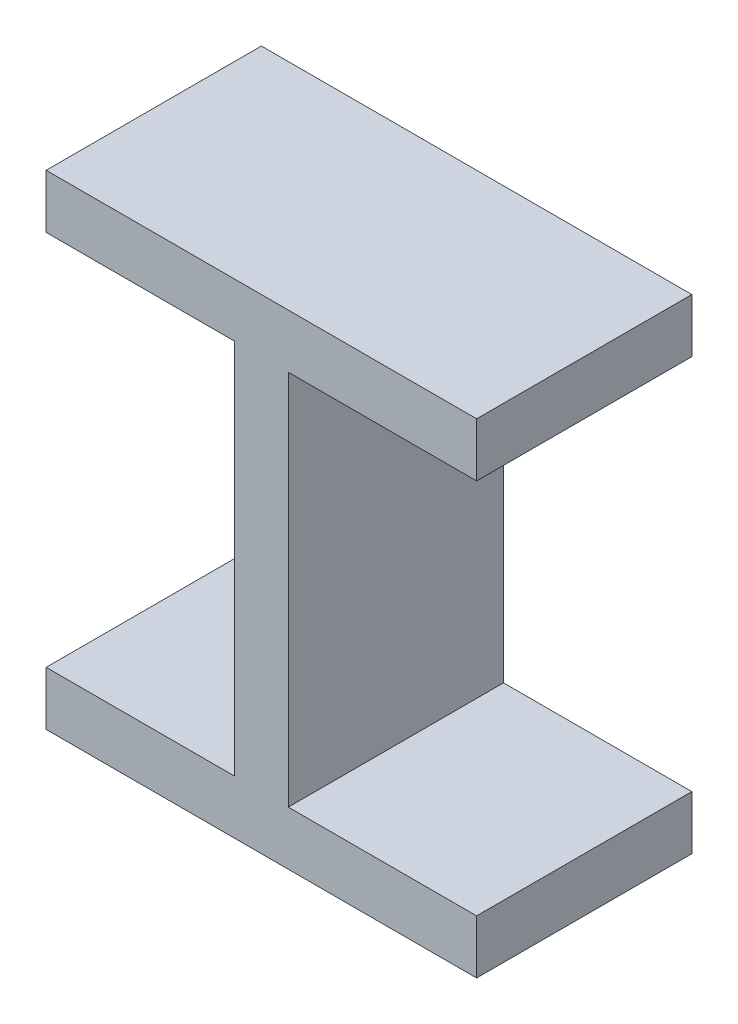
from build123d import *

# Parameters (mm, degrees)
BOSS_EXTRUDE1_DEPTH = 80


with BuildPart() as part:
    # Sketch2 → Boss-Extrude1 (new body)
    with BuildSketch(Plane.XY):
        Polygon((80, 90), (-80, 90), (-80, 70), (-10, 70), (-10, 0), (-10, -70), (-80, -70), (-80, -90), (80, -90), (80, -70), (10, -70), (10, 0), (10, 70), (80, 70), align=None)
    extrude(amount=BOSS_EXTRUDE1_DEPTH)


solid = part.part
